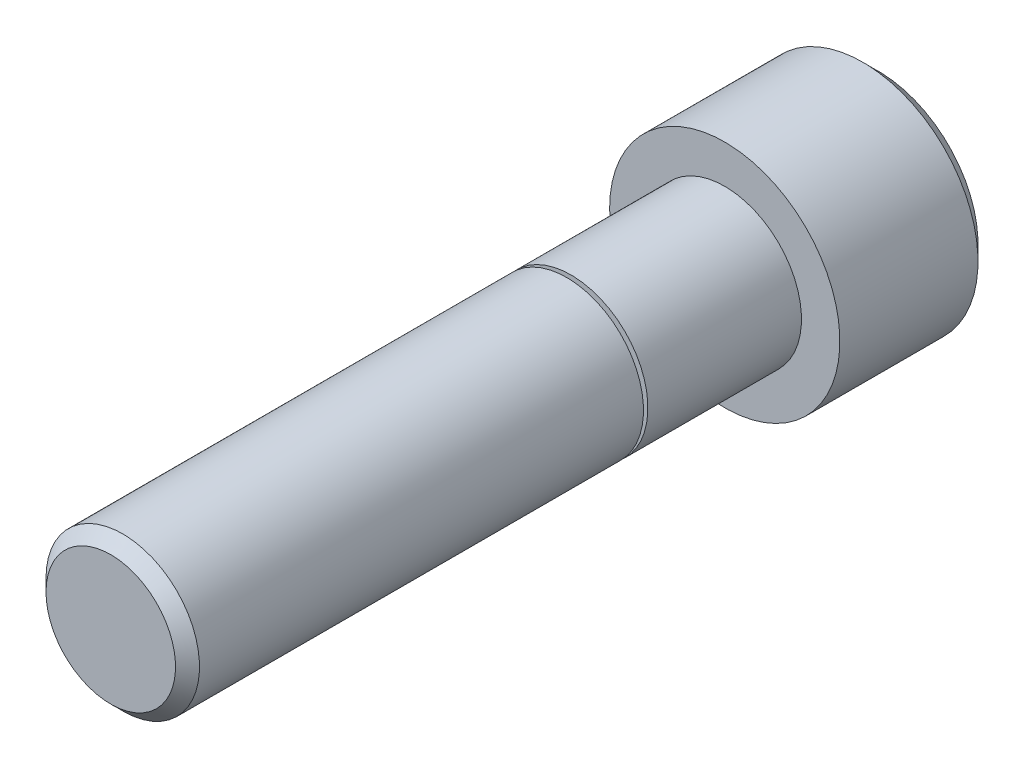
from build123d import *

# Parameters (mm, degrees)
CUT_EXTRUDE1_DEPTH = 6.35


with BuildPart() as part:
    # Logo3_bib1 → Revolve1 (revolve)
    with BuildSketch(Plane(origin=(0, 0, 0), x_dir=(-1, 0, 0), z_dir=(0, -1, 0))):
        with BuildLine():
            Line((0, -50.8), (0, 12.7))
            Line((0, 12.7), (8.255, 12.7))
            Line((8.255, 12.7), (9.525, 11.43))
            Line((9.525, 11.43), (9.525, 0))
            Line((9.525, 0), (6.35, 0))
            Line((6.35, 0), (6.35, -12.71))
            Line((6.35, -12.71), (5.471555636, -12.71))
            ThreePointArc((5.471555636, -12.71), (5.451859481, -12.726527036), (5.464715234, -12.748793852))
            Line((5.464715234, -12.748793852), (6.35, -13.071011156))
            Line((6.35, -13.071011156), (6.35, -49.80813))
            Line((6.35, -49.80813), (5.35813, -50.8))
            Line((5.35813, -50.8), (0, -50.8))
        make_face()
    revolve(axis=Axis((0, 0, -10.585154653), (0, 0, 1)))

    # Logo3_bib2 → Cut-Extrude1 (cut)
    with BuildSketch(Plane(origin=(0, 0, -12.7), x_dir=(1, 0, 0), z_dir=(0, 0, -1))):
        Polygon((5.499261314, 0), (2.749630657, 4.7625), (-2.749630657, 4.7625), (-5.499261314, 0), (-2.749630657, -4.7625), (2.749630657, -4.7625), align=None)
    extrude(amount=-CUT_EXTRUDE1_DEPTH, mode=Mode.SUBTRACT)


solid = part.part
